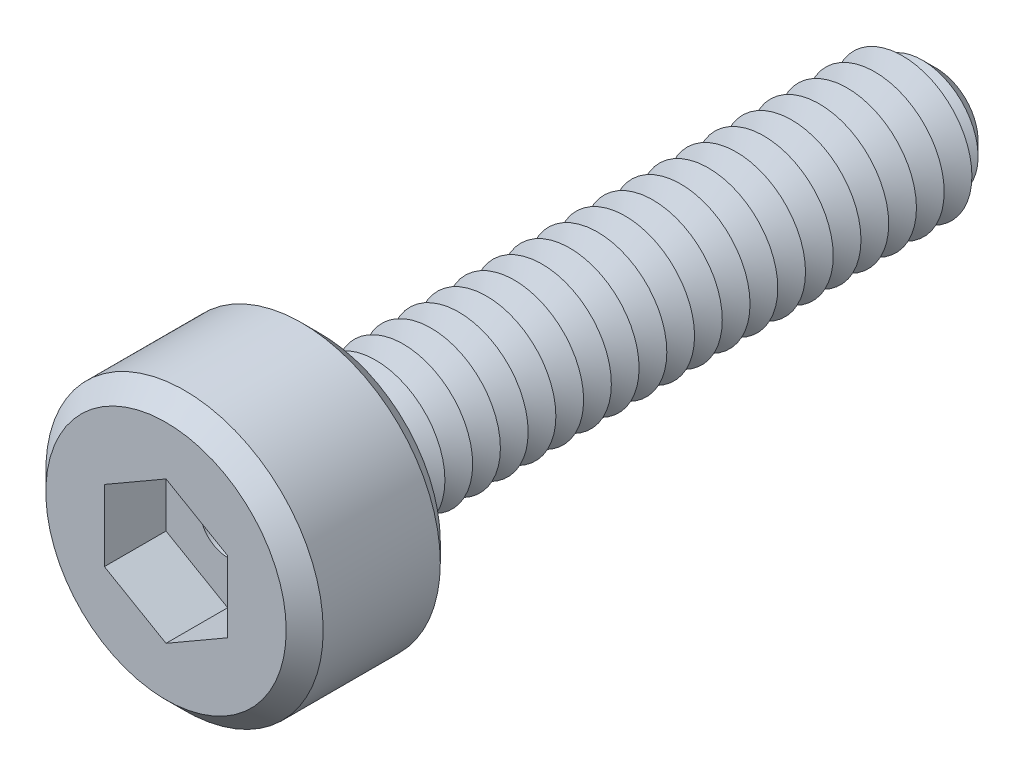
from build123d import *

# Parameters (mm, degrees)
SKETCH1_R           = 2.25
BOSS_EXTRUDE1_DEPTH = 2.5
SKETCH2_R           = 1.125
BOSS_EXTRUDE2_DEPTH = 10
CHAMFER1_SIZE       = 0.45
LPATTERN1_COUNT     = 22
LPATTERN1_PITCH     = 0.45
CUT_EXTRUDE1_DEPTH  = 1
SKETCH6_R           = 0.45
CUT_EXTRUDE2_DEPTH  = 11.5
CHAMFER2_SIZE       = 0.3


with BuildPart() as part:
    # Sketch1 → Boss-Extrude1 (new body)
    with BuildSketch(Plane.XY):
        Circle(SKETCH1_R)
    extrude(amount=BOSS_EXTRUDE1_DEPTH)

    # Sketch2 → Boss-Extrude2 (add)
    with BuildSketch(Plane(origin=(0, 0, 0), x_dir=(-1, 0, 0), z_dir=(0, 0, -1))):
        Circle(SKETCH2_R)
    extrude(amount=BOSS_EXTRUDE2_DEPTH)

    # Chamfer1
    chamfer1_edges = [part.edges().sort_by_distance(p)[0] for p in [
        (1.125, 0, -10),
    ]]
    chamfer(chamfer1_edges, length=CHAMFER1_SIZE)

    # Sketch4 → Cut-Revolve1 (revolve, cut)
    with BuildSketch(Plane(origin=(0, 0, 0), x_dir=(0, 0, -1), z_dir=(1, 0, 0)), mode=Mode.PRIVATE) as cut_revolve1_sk:
        Polygon((0, 1.125), (0.225, 0.735288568), (0.45, 1.125), align=None)
    cut_revolve1 = revolve(cut_revolve1_sk.sketch.rotate(Axis((0, 0, 2.512122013), (0, 0, -1)), 90), axis=Axis((0, 0, 2.512122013), (0, 0, -1)), mode=Mode.SUBTRACT)

    # LPattern1: Cut-Revolve1 ×22
    with Locations(*[(0, 0, -i * LPATTERN1_PITCH) for i in range(1, LPATTERN1_COUNT)]):
        add(cut_revolve1, mode=Mode.SUBTRACT)

    # Sketch5 → Cut-Extrude1 (cut)
    with BuildSketch(Plane.XY.offset(2.5)):
        Polygon((0, 1.154700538), (-1, 0.577350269), (-1, -0.577350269), (0, -1.154700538), (1, -0.577350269), (1, 0.577350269), align=None)
    extrude(amount=-CUT_EXTRUDE1_DEPTH, mode=Mode.SUBTRACT)

    # Sketch6 → Cut-Extrude2 (cut)
    with BuildSketch(Plane.XY.offset(1.5)):
        Circle(SKETCH6_R)
    extrude(amount=-CUT_EXTRUDE2_DEPTH, mode=Mode.SUBTRACT)

    # Chamfer2
    chamfer2_edges = [part.edges().sort_by_distance(p)[0] for p in [
        (-2.25, 0, 0),
        (-2.25, 0, 2.5),
    ]]
    chamfer(chamfer2_edges, length=CHAMFER2_SIZE)


solid = part.part
